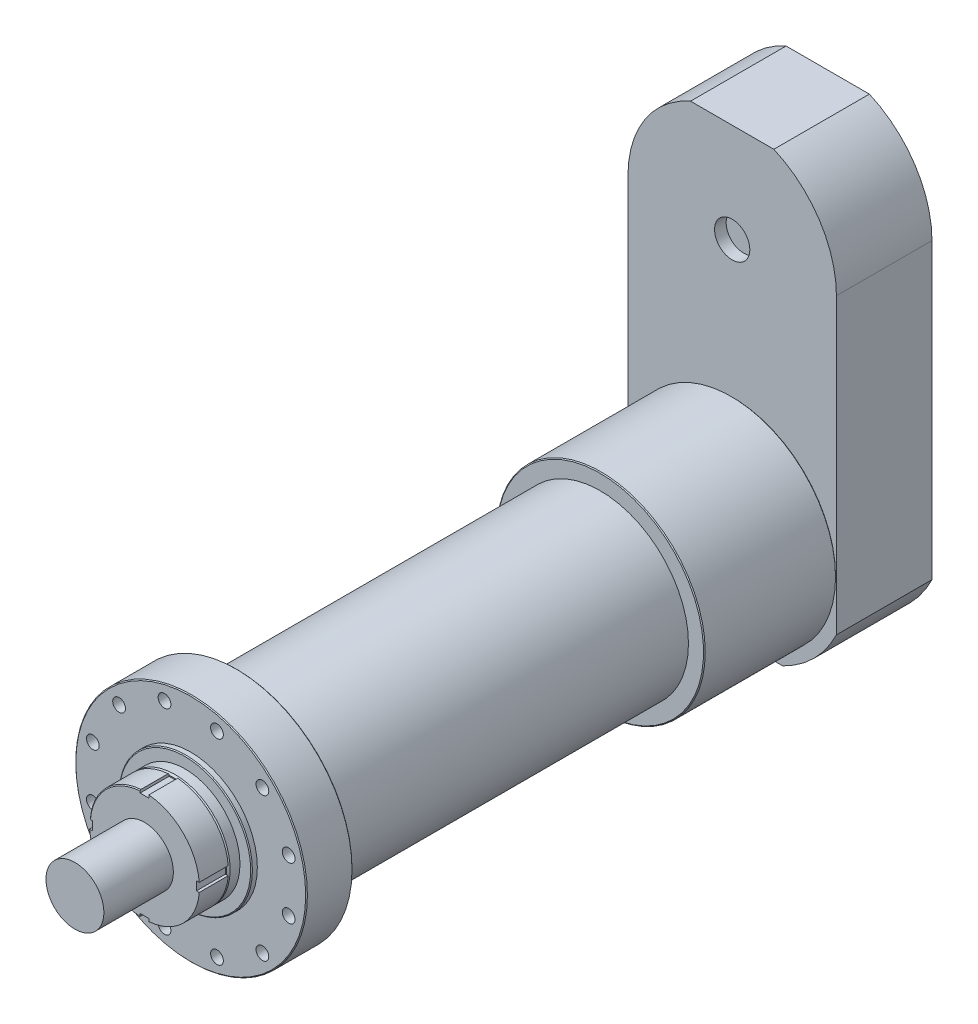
from build123d import *

# Parameters (mm, degrees)
SKETCH_1_R          = 152.5
EXTRUDE_1_DEPTH     = 627
SKETCH_2_R          = 200
SKETCH_2_R_2        = 11
EXTRUDE_2_DEPTH     = 80
SKETCH_3_R          = 115
EXTRUDE_3_DEPTH     = 10
SKETCH_4_R          = 95
EXTRUDE_4_DEPTH     = 20
CHAMFER_1_SIZE      = 3
EXTRUDE_5_DEPTH     = 50
CHAMFER_2_SIZE      = 1.5
SKETCH_11_R         = 180
EXTRUDE_10_DEPTH    = 228
CHAMFER_5_SIZE      = 1.5
EXTRUDE_11_DEPTH    = 165
SKETCH_16_R         = 16
CUT_EXTRUDE_4_DEPTH = 2
SKETCH_18_R         = 30.440746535
CUT_EXTRUDE_6_DEPTH = 20
SKETCH_19_R         = 50
EXTRUDE_12_DEPTH    = 120


with BuildPart() as part:
    # Sketch 1 → Extrude 1 (new body)
    with BuildSketch(Plane.XY):
        Circle(SKETCH_1_R)
    extrude(amount=EXTRUDE_1_DEPTH)

    # Sketch 2 → Extrude 2 (add)
    with BuildSketch(Plane.XY.offset(627)):
        Circle(SKETCH_2_R)
        with Locations((169.037019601, 45.293332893)):
            Circle(SKETCH_2_R_2, mode=Mode.SUBTRACT)
        with Locations((169.037019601, -45.293332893)):
            Circle(SKETCH_2_R_2, mode=Mode.SUBTRACT)
        with Locations((123.743686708, -123.743686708)):
            Circle(SKETCH_2_R_2, mode=Mode.SUBTRACT)
        with Locations((45.293332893, -169.037019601)):
            Circle(SKETCH_2_R_2, mode=Mode.SUBTRACT)
        with Locations((-45.293332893, -169.037019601)):
            Circle(SKETCH_2_R_2, mode=Mode.SUBTRACT)
        with Locations((-123.743686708, -123.743686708)):
            Circle(SKETCH_2_R_2, mode=Mode.SUBTRACT)
        with Locations((-169.037019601, -45.293332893)):
            Circle(SKETCH_2_R_2, mode=Mode.SUBTRACT)
        with Locations((-169.037019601, 45.293332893)):
            Circle(SKETCH_2_R_2, mode=Mode.SUBTRACT)
        with Locations((-123.743686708, 123.743686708)):
            Circle(SKETCH_2_R_2, mode=Mode.SUBTRACT)
        with Locations((-45.293332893, 169.037019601)):
            Circle(SKETCH_2_R_2, mode=Mode.SUBTRACT)
        with Locations((45.293332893, 169.037019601)):
            Circle(SKETCH_2_R_2, mode=Mode.SUBTRACT)
        with Locations((123.743686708, 123.743686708)):
            Circle(SKETCH_2_R_2, mode=Mode.SUBTRACT)
    extrude(amount=EXTRUDE_2_DEPTH)

    # Sketch 3 → Extrude 3 (add)
    with BuildSketch(Plane.XY.offset(707)):
        Circle(SKETCH_3_R)
    extrude(amount=EXTRUDE_3_DEPTH)

    # Sketch 4 → Extrude 4 (add)
    with BuildSketch(Plane.XY.offset(717)):
        Circle(SKETCH_4_R)
    extrude(amount=EXTRUDE_4_DEPTH)

    # Chamfer 1
    chamfer_1_edges = [part.edges().sort_by_distance(p)[0] for p in [
        (-95, 0, 737),
    ]]
    chamfer(chamfer_1_edges, length=CHAMFER_1_SIZE)

    # Sketch 5 → Extrude 5 (add)
    with BuildSketch(Plane.XY.offset(737)):
        with BuildLine():
            Line((-7.5, 94.703484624), (-7.5, 90))
            Line((-7.5, 90), (7.5, 90))
            Line((7.5, 90), (7.5, 94.703484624))
            ThreePointArc((7.5, 94.703484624), (67.175144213, 67.175144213), (94.703484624, 7.5))
            Line((94.703484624, 7.5), (90, 7.5))
            Line((90, 7.5), (90, -7.5))
            Line((90, -7.5), (94.703484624, -7.5))
            ThreePointArc((94.703484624, -7.5), (67.175144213, -67.175144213), (7.5, -94.703484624))
            Line((7.5, -94.703484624), (7.5, -90))
            Line((7.5, -90), (-7.5, -90))
            Line((-7.5, -90), (-7.5, -94.703484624))
            ThreePointArc((-7.5, -94.703484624), (-67.175144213, -67.175144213), (-94.703484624, -7.5))
            Line((-94.703484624, -7.5), (-90, -7.5))
            Line((-90, -7.5), (-90, 7.5))
            Line((-90, 7.5), (-94.703484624, 7.5))
            ThreePointArc((-94.703484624, 7.5), (-67.175144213, 67.175144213), (-7.5, 94.703484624))
        make_face()
    extrude(amount=EXTRUDE_5_DEPTH)

    # Chamfer 2
    chamfer_2_edges = [part.edges().sort_by_distance(p)[0] for p in [
        (-115, 0, 717),
        (-67.175144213, 67.175144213, 737),
        (-200, 0, 707),
        (-67.175144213, 67.175144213, 787),
        (-200, 0, 627),
    ]]
    chamfer(chamfer_2_edges, length=CHAMFER_2_SIZE)

    # Sketch 11 → Extrude 10 (add)
    with BuildSketch(Plane(origin=(0, 0, 0), x_dir=(-1, 0, 0), z_dir=(0, 0, -1))):
        with Locations(Location((0, 0, 0), (0, 0, 180))):
            Circle(SKETCH_11_R)
    extrude(amount=EXTRUDE_10_DEPTH)

    # Chamfer 5
    chamfer_5_edges = [part.edges().sort_by_distance(p)[0] for p in [
        (-180, 0, 0),
        (-180, 0, -228),
    ]]
    chamfer(chamfer_5_edges, length=CHAMFER_5_SIZE)

    # Sketch 16 → Cut-Extrude 4 (cut)
    with BuildSketch(Plane(origin=(-152.5, 0, 0), x_dir=(0, 0, -1), z_dir=(1, 0, 0))):
        with Locations(Location((-27, 0, 0), (0, 0, 180))):
            Circle(SKETCH_16_R)
        with Locations(Location((-551.5, 0, 0), (0, 0, 180))):
            Circle(SKETCH_16_R)
    extrude(amount=CUT_EXTRUDE_4_DEPTH, mode=Mode.SUBTRACT)

    # Sketch 19 → Extrude 12 (add)
    with BuildSketch(Plane.XY.offset(787)):
        Circle(SKETCH_19_R)
    extrude(amount=EXTRUDE_12_DEPTH)


with BuildPart() as body_2:
    # Sketch 12 → Extrude 11 (new body)
    with BuildSketch(Plane(origin=(0, 0, -228), x_dir=(-1, 0, 0), z_dir=(0, 0, -1))):
        with BuildLine():
            Line((-87.177978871, -180), (87.177978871, -180))
            ThreePointArc((87.177978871, -180), (141.421356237, -141.421356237), (180, -87.177978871))
            Line((180, -87.177978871), (180, 420))
            ThreePointArc((180, 420), (150.580120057, 518.61859583), (71.93747285, 585))
            Line((71.93747285, 585), (-71.93747285, 585))
            ThreePointArc((-71.93747285, 585), (-150.580120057, 518.61859583), (-180, 420))
            Line((-180, 420), (-180, -87.177978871))
            ThreePointArc((-180, -87.177978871), (-141.421356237, -141.421356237), (-87.177978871, -180))
        make_face()
    extrude(amount=EXTRUDE_11_DEPTH)

    # Sketch 18 → Cut-Extrude 6 (cut)
    with BuildSketch(Plane.XY.offset(-228)):
        with Locations((0, 414)):
            Circle(SKETCH_18_R)
    extrude(amount=-CUT_EXTRUDE_6_DEPTH, mode=Mode.SUBTRACT)


solid = Compound([part.part, body_2.part])
